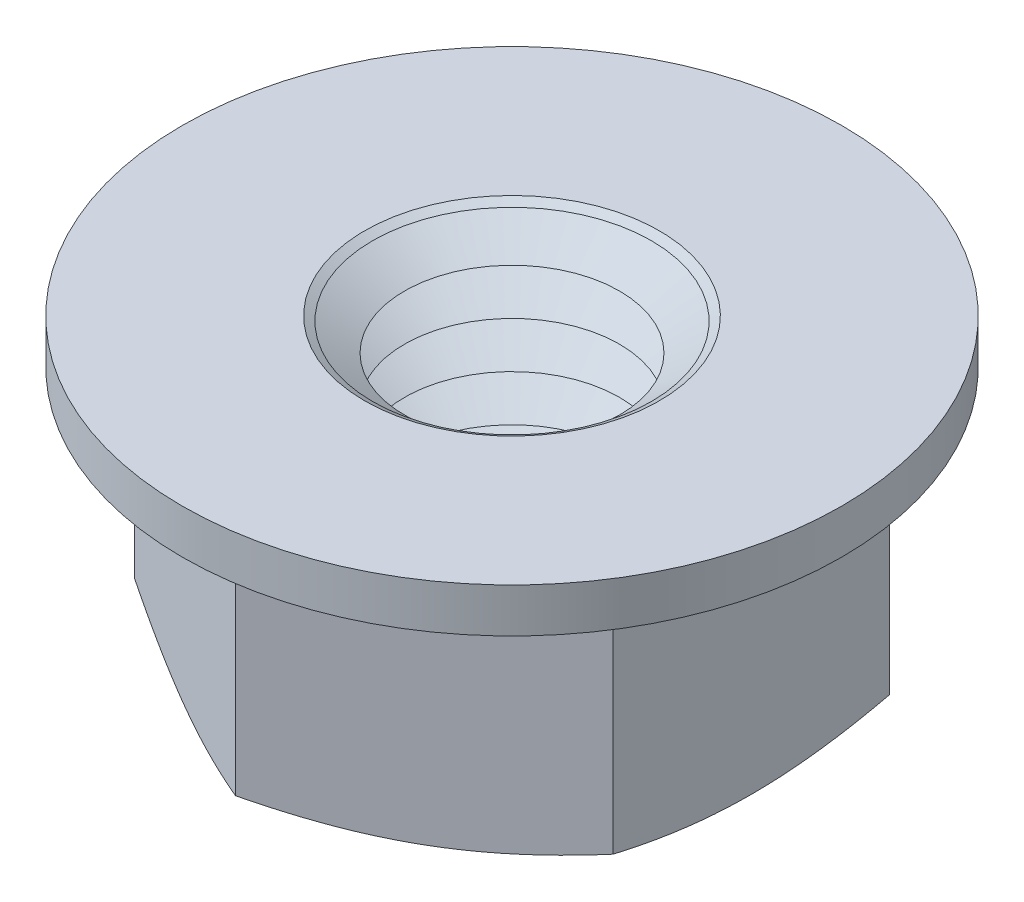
ISO-10303-21;
HEADER;
FILE_DESCRIPTION(('STEP AP214'),'2;1');
FILE_NAME('part.step','',(''),(''),'','','');
FILE_SCHEMA(('AUTOMOTIVE_DESIGN { 1 0 10303 214 1 1 1 1 }'));
ENDSEC;
DATA;
#1=APPLICATION_CONTEXT('core data for automotive mechanical design processes');
#2=APPLICATION_PROTOCOL_DEFINITION('international standard','automotive_design',2000,#1);
#3=PRODUCT_CONTEXT('',#1,'mechanical');
#4=PRODUCT('Part','Part','',(#3));
#5=PRODUCT_RELATED_PRODUCT_CATEGORY('part','',(#4));
#6=PRODUCT_DEFINITION_FORMATION('','',#4);
#7=PRODUCT_DEFINITION_CONTEXT('part definition',#1,'design');
#8=PRODUCT_DEFINITION('design','',#6,#7);
#9=PRODUCT_DEFINITION_SHAPE('','',#8);
#10=(LENGTH_UNIT() NAMED_UNIT(*) SI_UNIT(.MILLI.,.METRE.));
#11=(NAMED_UNIT(*) PLANE_ANGLE_UNIT() SI_UNIT($,.RADIAN.));
#12=(NAMED_UNIT(*) SI_UNIT($,.STERADIAN.) SOLID_ANGLE_UNIT());
#13=UNCERTAINTY_MEASURE_WITH_UNIT(LENGTH_MEASURE(1.E-05),#10,'distance_accuracy_value','');
#14=(GEOMETRIC_REPRESENTATION_CONTEXT(3) GLOBAL_UNCERTAINTY_ASSIGNED_CONTEXT((#13)) GLOBAL_UNIT_ASSIGNED_CONTEXT((#10,
#11,#12)) REPRESENTATION_CONTEXT('',''));
#15=CARTESIAN_POINT('',(0.,0.,0.));
#16=DIRECTION('',(0.,0.,1.));
#17=DIRECTION('',(1.,0.,0.));
#18=AXIS2_PLACEMENT_3D('',#15,#16,#17);
#19=CARTESIAN_POINT('',(0.,-4.62500000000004,0.));
#20=DIRECTION('',(0.,-1.,0.));
#21=DIRECTION('',(0.,0.,-1.));
#22=AXIS2_PLACEMENT_3D('',#19,#20,#21);
#23=CONICAL_SURFACE('',#22,2.91746824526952,1.04719755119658);
#24=CARTESIAN_POINT('',(0.,-5.25000000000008,0.));
#25=DIRECTION('',(0.,1.,0.));
#26=DIRECTION('',(0.,0.,1.));
#27=AXIS2_PLACEMENT_3D('',#24,#25,#26);
#28=CIRCLE('',#27,4.0000000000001);
#29=CARTESIAN_POINT('',(0.,-5.25000000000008,4.0000000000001));
#30=VERTEX_POINT('',#29);
#31=EDGE_CURVE('E206',#30,#30,#28,.T.);
#32=ORIENTED_EDGE('',*,*,#31,.F.);
#33=EDGE_LOOP('',(#32));
#34=FACE_BOUND('',#33,.T.);
#35=CARTESIAN_POINT('',(0.,-4.62500000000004,0.));
#36=DIRECTION('',(0.,-1.,0.));
#37=DIRECTION('',(0.,0.,-1.));
#38=AXIS2_PLACEMENT_3D('',#35,#36,#37);
#39=CIRCLE('',#38,2.91746824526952);
#40=CARTESIAN_POINT('',(0.,-4.62500000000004,-2.91746824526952));
#41=VERTEX_POINT('',#40);
#42=EDGE_CURVE('E209',#41,#41,#39,.T.);
#43=ORIENTED_EDGE('',*,*,#42,.F.);
#44=EDGE_LOOP('',(#43));
#45=FACE_BOUND('',#44,.T.);
#46=ADVANCED_FACE('F17',(#34,#45),#23,.F.);
#47=CARTESIAN_POINT('',(0.,-4.62500000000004,0.));
#48=DIRECTION('',(0.,1.,0.));
#49=DIRECTION('',(0.,0.,1.));
#50=AXIS2_PLACEMENT_3D('',#47,#48,#49);
#51=CONICAL_SURFACE('',#50,2.91746824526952,1.04719755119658);
#52=ORIENTED_EDGE('',*,*,#42,.T.);
#53=EDGE_LOOP('',(#52));
#54=FACE_BOUND('',#53,.T.);
#55=CARTESIAN_POINT('',(0.,-4.00000000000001,0.));
#56=DIRECTION('',(0.,-1.,0.));
#57=DIRECTION('',(0.,0.,-1.));
#58=AXIS2_PLACEMENT_3D('',#55,#56,#57);
#59=CIRCLE('',#58,4.0000000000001);
#60=CARTESIAN_POINT('',(0.,-4.00000000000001,-4.0000000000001));
#61=VERTEX_POINT('',#60);
#62=EDGE_CURVE('E203',#61,#61,#59,.T.);
#63=ORIENTED_EDGE('',*,*,#62,.F.);
#64=EDGE_LOOP('',(#63));
#65=FACE_BOUND('',#64,.T.);
#66=ADVANCED_FACE('F565',(#54,#65),#51,.F.);
#67=CARTESIAN_POINT('',(0.,-5.87500000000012,0.));
#68=DIRECTION('',(0.,1.,0.));
#69=DIRECTION('',(0.,0.,1.));
#70=AXIS2_PLACEMENT_3D('',#67,#68,#69);
#71=CONICAL_SURFACE('',#70,2.91746824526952,1.04719755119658);
#72=ORIENTED_EDGE('',*,*,#31,.T.);
#73=EDGE_LOOP('',(#72));
#74=FACE_BOUND('',#73,.T.);
#75=CARTESIAN_POINT('',(0.,-5.87500000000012,0.));
#76=DIRECTION('',(0.,1.,0.));
#77=DIRECTION('',(0.,0.,1.));
#78=AXIS2_PLACEMENT_3D('',#75,#76,#77);
#79=CIRCLE('',#78,2.91746824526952);
#80=CARTESIAN_POINT('',(0.,-5.87500000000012,2.91746824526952));
#81=VERTEX_POINT('',#80);
#82=EDGE_CURVE('E200',#81,#81,#79,.T.);
#83=ORIENTED_EDGE('',*,*,#82,.F.);
#84=EDGE_LOOP('',(#83));
#85=FACE_BOUND('',#84,.T.);
#86=ADVANCED_FACE('F557',(#74,#85),#71,.F.);
#87=CARTESIAN_POINT('',(0.,-3.37499999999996,0.));
#88=DIRECTION('',(0.,-1.,0.));
#89=DIRECTION('',(0.,0.,-1.));
#90=AXIS2_PLACEMENT_3D('',#87,#88,#89);
#91=CONICAL_SURFACE('',#90,2.91746824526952,1.04719755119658);
#92=CARTESIAN_POINT('',(0.,-3.37499999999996,0.));
#93=DIRECTION('',(0.,-1.,0.));
#94=DIRECTION('',(0.,0.,-1.));
#95=AXIS2_PLACEMENT_3D('',#92,#93,#94);
#96=CIRCLE('',#95,2.91746824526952);
#97=CARTESIAN_POINT('',(0.,-3.37499999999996,-2.91746824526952));
#98=VERTEX_POINT('',#97);
#99=EDGE_CURVE('E197',#98,#98,#96,.T.);
#100=ORIENTED_EDGE('',*,*,#99,.F.);
#101=EDGE_LOOP('',(#100));
#102=FACE_BOUND('',#101,.T.);
#103=ORIENTED_EDGE('',*,*,#62,.T.);
#104=EDGE_LOOP('',(#103));
#105=FACE_BOUND('',#104,.T.);
#106=ADVANCED_FACE('F549',(#102,#105),#91,.F.);
#107=CARTESIAN_POINT('',(0.,-5.87500000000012,0.));
#108=DIRECTION('',(0.,-1.,0.));
#109=DIRECTION('',(0.,0.,-1.));
#110=AXIS2_PLACEMENT_3D('',#107,#108,#109);
#111=CONICAL_SURFACE('',#110,2.91746824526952,1.04719755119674);
#112=CARTESIAN_POINT('',(0.,-6.49999999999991,0.));
#113=DIRECTION('',(0.,1.,0.));
#114=DIRECTION('',(0.,0.,1.));
#115=AXIS2_PLACEMENT_3D('',#112,#113,#114);
#116=CIRCLE('',#115,4.0000000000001);
#117=CARTESIAN_POINT('',(0.,-6.49999999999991,4.0000000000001));
#118=VERTEX_POINT('',#117);
#119=EDGE_CURVE('E194',#118,#118,#116,.T.);
#120=ORIENTED_EDGE('',*,*,#119,.F.);
#121=EDGE_LOOP('',(#120));
#122=FACE_BOUND('',#121,.T.);
#123=ORIENTED_EDGE('',*,*,#82,.T.);
#124=EDGE_LOOP('',(#123));
#125=FACE_BOUND('',#124,.T.);
#126=ADVANCED_FACE('F541',(#122,#125),#111,.F.);
#127=CARTESIAN_POINT('',(0.,-3.37499999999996,0.));
#128=DIRECTION('',(0.,1.,0.));
#129=DIRECTION('',(0.,0.,1.));
#130=AXIS2_PLACEMENT_3D('',#127,#128,#129);
#131=CONICAL_SURFACE('',#130,2.91746824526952,1.04719755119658);
#132=ORIENTED_EDGE('',*,*,#99,.T.);
#133=EDGE_LOOP('',(#132));
#134=FACE_BOUND('',#133,.T.);
#135=CARTESIAN_POINT('',(0.,-2.74999999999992,0.));
#136=DIRECTION('',(0.,-1.,0.));
#137=DIRECTION('',(1.,0.,0.));
#138=AXIS2_PLACEMENT_3D('',#135,#136,#137);
#139=CIRCLE('',#138,4.0000000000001);
#140=CARTESIAN_POINT('',(4.0000000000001,-2.74999999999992,0.));
#141=VERTEX_POINT('',#140);
#142=EDGE_CURVE('E191',#141,#141,#139,.T.);
#143=ORIENTED_EDGE('',*,*,#142,.F.);
#144=EDGE_LOOP('',(#143));
#145=FACE_BOUND('',#144,.T.);
#146=ADVANCED_FACE('F533',(#134,#145),#131,.F.);
#147=CARTESIAN_POINT('',(0.,-7.12499999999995,0.));
#148=DIRECTION('',(0.,1.,0.));
#149=DIRECTION('',(-1.,0.,0.));
#150=AXIS2_PLACEMENT_3D('',#147,#148,#149);
#151=CONICAL_SURFACE('',#150,2.91746824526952,1.04719755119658);
#152=ORIENTED_EDGE('',*,*,#119,.T.);
#153=EDGE_LOOP('',(#152));
#154=FACE_BOUND('',#153,.T.);
#155=CARTESIAN_POINT('',(0.,-7.12499999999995,0.));
#156=DIRECTION('',(0.,1.,0.));
#157=DIRECTION('',(-1.,0.,0.));
#158=AXIS2_PLACEMENT_3D('',#155,#156,#157);
#159=CIRCLE('',#158,2.91746824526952);
#160=CARTESIAN_POINT('',(-2.91746824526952,-7.12499999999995,0.));
#161=VERTEX_POINT('',#160);
#162=EDGE_CURVE('E188',#161,#161,#159,.T.);
#163=ORIENTED_EDGE('',*,*,#162,.F.);
#164=EDGE_LOOP('',(#163));
#165=FACE_BOUND('',#164,.T.);
#166=ADVANCED_FACE('F525',(#154,#165),#151,.F.);
#167=CARTESIAN_POINT('',(0.,-2.12499999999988,0.));
#168=DIRECTION('',(0.,-1.,0.));
#169=DIRECTION('',(0.,0.,-1.));
#170=AXIS2_PLACEMENT_3D('',#167,#168,#169);
#171=CONICAL_SURFACE('',#170,2.91746824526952,1.04719755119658);
#172=CARTESIAN_POINT('',(0.,-2.12499999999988,0.));
#173=DIRECTION('',(0.,-1.,0.));
#174=DIRECTION('',(0.,0.,-1.));
#175=AXIS2_PLACEMENT_3D('',#172,#173,#174);
#176=CIRCLE('',#175,2.91746824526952);
#177=CARTESIAN_POINT('',(0.,-2.12499999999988,-2.91746824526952));
#178=VERTEX_POINT('',#177);
#179=EDGE_CURVE('E185',#178,#178,#176,.T.);
#180=ORIENTED_EDGE('',*,*,#179,.F.);
#181=EDGE_LOOP('',(#180));
#182=FACE_BOUND('',#181,.T.);
#183=ORIENTED_EDGE('',*,*,#142,.T.);
#184=EDGE_LOOP('',(#183));
#185=FACE_BOUND('',#184,.T.);
#186=ADVANCED_FACE('F517',(#182,#185),#171,.F.);
#187=CARTESIAN_POINT('',(0.,-7.12499999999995,0.));
#188=DIRECTION('',(0.,-1.,0.));
#189=DIRECTION('',(1.,0.,0.));
#190=AXIS2_PLACEMENT_3D('',#187,#188,#189);
#191=CONICAL_SURFACE('',#190,2.91746824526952,1.04719755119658);
#192=CARTESIAN_POINT('',(0.,-7.75000000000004,0.));
#193=DIRECTION('',(0.,1.,0.));
#194=DIRECTION('',(0.,0.,1.));
#195=AXIS2_PLACEMENT_3D('',#192,#193,#194);
#196=CIRCLE('',#195,4.00000000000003);
#197=CARTESIAN_POINT('',(0.,-7.75000000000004,4.00000000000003));
#198=VERTEX_POINT('',#197);
#199=EDGE_CURVE('E182',#198,#198,#196,.T.);
#200=ORIENTED_EDGE('',*,*,#199,.F.);
#201=EDGE_LOOP('',(#200));
#202=FACE_BOUND('',#201,.T.);
#203=ORIENTED_EDGE('',*,*,#162,.T.);
#204=EDGE_LOOP('',(#203));
#205=FACE_BOUND('',#204,.T.);
#206=ADVANCED_FACE('F509',(#202,#205),#191,.F.);
#207=CARTESIAN_POINT('',(0.,-2.12499999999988,0.));
#208=DIRECTION('',(0.,1.,0.));
#209=DIRECTION('',(0.,0.,1.));
#210=AXIS2_PLACEMENT_3D('',#207,#208,#209);
#211=CONICAL_SURFACE('',#210,2.91746824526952,1.04719755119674);
#212=ORIENTED_EDGE('',*,*,#179,.T.);
#213=EDGE_LOOP('',(#212));
#214=FACE_BOUND('',#213,.T.);
#215=CARTESIAN_POINT('',(0.,-1.5000000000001,0.));
#216=DIRECTION('',(0.,-1.,0.));
#217=DIRECTION('',(0.,0.,-1.));
#218=AXIS2_PLACEMENT_3D('',#215,#216,#217);
#219=CIRCLE('',#218,4.0000000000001);
#220=CARTESIAN_POINT('',(0.,-1.5000000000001,-4.0000000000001));
#221=VERTEX_POINT('',#220);
#222=EDGE_CURVE('E179',#221,#221,#219,.T.);
#223=ORIENTED_EDGE('',*,*,#222,.F.);
#224=EDGE_LOOP('',(#223));
#225=FACE_BOUND('',#224,.T.);
#226=ADVANCED_FACE('F501',(#214,#225),#211,.F.);
#227=CARTESIAN_POINT('',(0.,-7.875,0.));
#228=DIRECTION('',(0.,1.,0.));
#229=DIRECTION('',(-1.,0.,0.));
#230=AXIS2_PLACEMENT_3D('',#227,#228,#229);
#231=CONICAL_SURFACE('',#230,3.78349364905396,1.04719755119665);
#232=ORIENTED_EDGE('',*,*,#199,.T.);
#233=EDGE_LOOP('',(#232));
#234=FACE_BOUND('',#233,.T.);
#235=CARTESIAN_POINT('',(0.,-7.875,0.));
#236=DIRECTION('',(0.,1.,0.));
#237=DIRECTION('',(-1.,0.,0.));
#238=AXIS2_PLACEMENT_3D('',#235,#236,#237);
#239=CIRCLE('',#238,3.78349364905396);
#240=CARTESIAN_POINT('',(-3.78349364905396,-7.875,0.));
#241=VERTEX_POINT('',#240);
#242=EDGE_CURVE('E176',#241,#241,#239,.T.);
#243=ORIENTED_EDGE('',*,*,#242,.F.);
#244=EDGE_LOOP('',(#243));
#245=FACE_BOUND('',#244,.T.);
#246=ADVANCED_FACE('F493',(#234,#245),#231,.F.);
#247=CARTESIAN_POINT('',(0.,-0.875000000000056,0.));
#248=DIRECTION('',(0.,-1.,0.));
#249=DIRECTION('',(1.,0.,0.));
#250=AXIS2_PLACEMENT_3D('',#247,#248,#249);
#251=CONICAL_SURFACE('',#250,2.91746824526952,1.04719755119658);
#252=CARTESIAN_POINT('',(0.,-0.875000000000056,0.));
#253=DIRECTION('',(0.,-1.,0.));
#254=DIRECTION('',(1.,0.,0.));
#255=AXIS2_PLACEMENT_3D('',#252,#253,#254);
#256=CIRCLE('',#255,2.91746824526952);
#257=CARTESIAN_POINT('',(2.91746824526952,-0.875000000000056,0.));
#258=VERTEX_POINT('',#257);
#259=EDGE_CURVE('E102',#258,#258,#256,.T.);
#260=ORIENTED_EDGE('',*,*,#259,.F.);
#261=EDGE_LOOP('',(#260));
#262=FACE_BOUND('',#261,.T.);
#263=ORIENTED_EDGE('',*,*,#222,.T.);
#264=EDGE_LOOP('',(#263));
#265=FACE_BOUND('',#264,.T.);
#266=ADVANCED_FACE('F486',(#262,#265),#251,.F.);
#267=CARTESIAN_POINT('',(0.,-7.875,0.));
#268=DIRECTION('',(0.,-1.,0.));
#269=DIRECTION('',(1.,0.,0.));
#270=AXIS2_PLACEMENT_3D('',#267,#268,#269);
#271=CONICAL_SURFACE('',#270,3.78349364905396,1.04719755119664);
#272=CARTESIAN_POINT('',(0.,-8.00000000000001,0.));
#273=DIRECTION('',(0.,-1.,0.));
#274=DIRECTION('',(0.,0.,-1.));
#275=AXIS2_PLACEMENT_3D('',#272,#273,#274);
#276=CIRCLE('',#275,4.00000000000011);
#277=CARTESIAN_POINT('',(0.,-8.00000000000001,-4.00000000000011));
#278=VERTEX_POINT('',#277);
#279=EDGE_CURVE('E160',#278,#278,#276,.F.);
#280=ORIENTED_EDGE('',*,*,#279,.F.);
#281=EDGE_LOOP('',(#280));
#282=FACE_BOUND('',#281,.T.);
#283=ORIENTED_EDGE('',*,*,#242,.T.);
#284=EDGE_LOOP('',(#283));
#285=FACE_BOUND('',#284,.T.);
#286=ADVANCED_FACE('F479',(#282,#285),#271,.F.);
#287=CARTESIAN_POINT('',(0.,-0.875000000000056,0.));
#288=DIRECTION('',(0.,1.,0.));
#289=DIRECTION('',(-1.,0.,0.));
#290=AXIS2_PLACEMENT_3D('',#287,#288,#289);
#291=CONICAL_SURFACE('',#290,2.91746824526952,1.04719755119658);
#292=ORIENTED_EDGE('',*,*,#259,.T.);
#293=EDGE_LOOP('',(#292));
#294=FACE_BOUND('',#293,.T.);
#295=CARTESIAN_POINT('',(0.,-0.24999999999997,0.));
#296=DIRECTION('',(0.,-1.,0.));
#297=DIRECTION('',(0.,0.,-1.));
#298=AXIS2_PLACEMENT_3D('',#295,#296,#297);
#299=CIRCLE('',#298,4.00000000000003);
#300=CARTESIAN_POINT('',(0.,-0.24999999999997,-4.00000000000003));
#301=VERTEX_POINT('',#300);
#302=EDGE_CURVE('E164',#301,#301,#299,.T.);
#303=ORIENTED_EDGE('',*,*,#302,.F.);
#304=EDGE_LOOP('',(#303));
#305=FACE_BOUND('',#304,.T.);
#306=ADVANCED_FACE('F137',(#294,#305),#291,.F.);
#307=CARTESIAN_POINT('',(1.95590071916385E-13,-7.48111825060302,6.92879727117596E-13));
#308=DIRECTION('',(0.,1.,0.));
#309=DIRECTION('',(-1.,0.,0.));
#310=AXIS2_PLACEMENT_3D('',#307,#308,#309);
#311=CONICAL_SURFACE('',#310,7.61274550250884,1.13446401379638);
#312=CARTESIAN_POINT('',(1.95590071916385E-13,-8.00000000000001,6.84722291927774E-13));
#313=DIRECTION('',(0.,-1.,0.));
#314=DIRECTION('',(0.,0.,-1.));
#315=AXIS2_PLACEMENT_3D('',#312,#313,#314);
#316=CIRCLE('',#315,6.50000000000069);
#317=CARTESIAN_POINT('',(-6.5000000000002,-8.00000000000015,0.));
#318=VERTEX_POINT('',#317);
#319=CARTESIAN_POINT('',(-3.2500000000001,-8.00000000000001,-5.62916512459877));
#320=VERTEX_POINT('',#319);
#321=EDGE_CURVE('E97',#318,#320,#316,.T.);
#322=ORIENTED_EDGE('',*,*,#321,.F.);
#323=CARTESIAN_POINT('',(-6.49999999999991,-7.53110270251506,-3.75277674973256));
#324=CARTESIAN_POINT('',(-6.49999999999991,-7.60291701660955,-3.44487637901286));
#325=CARTESIAN_POINT('',(-6.49999999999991,-7.66845556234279,-3.1353170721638));
#326=CARTESIAN_POINT('',(-6.49999999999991,-7.7838219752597,-2.514385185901));
#327=CARTESIAN_POINT('',(-6.49999999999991,-7.83370190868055,-2.20302219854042));
#328=CARTESIAN_POINT('',(-6.49999999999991,-7.89477851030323,-1.73405633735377));
#329=CARTESIAN_POINT('',(-6.49999999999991,-7.91285157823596,-1.57734721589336));
#330=CARTESIAN_POINT('',(-6.49999999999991,-7.94410021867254,-1.26343980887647));
#331=CARTESIAN_POINT('',(-6.49999999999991,-7.95727586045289,-1.10624153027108));
#332=CARTESIAN_POINT('',(-6.49999999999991,-7.97850910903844,-0.790970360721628));
#333=CARTESIAN_POINT('',(-6.49999999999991,-7.98654948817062,-0.632896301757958));
#334=CARTESIAN_POINT('',(-6.49999999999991,-7.99730463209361,-0.316549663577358));
#335=CARTESIAN_POINT('',(-6.49999999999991,-8.00001878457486,-0.158277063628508));
#336=CARTESIAN_POINT('',(-6.49999999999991,-8.00000000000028,0.));
#337=B_SPLINE_CURVE_WITH_KNOTS('',3,(#323,#324,#325,#326,#327,#328,#329,#330,#331,#332,#333,
#334,#335,#336),.UNSPECIFIED.,.F.,.F.,(4,2,2,2,2,2,4),(0.,0.948732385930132,1.89427589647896,
2.36744958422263,2.84061657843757,3.31536271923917,3.79016343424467),.UNSPECIFIED.);
#338=CARTESIAN_POINT('',(-6.49999999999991,-7.53110270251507,-3.75277674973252));
#339=VERTEX_POINT('',#338);
#340=EDGE_CURVE('E21',#339,#318,#337,.T.);
#341=ORIENTED_EDGE('',*,*,#340,.F.);
#342=CARTESIAN_POINT('',(-3.24999999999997,-8.00000000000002,-5.62916512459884));
#343=CARTESIAN_POINT('',(-3.38707195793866,-8.0000187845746,-5.55002659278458));
#344=CARTESIAN_POINT('',(-3.52414005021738,-7.99730463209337,-5.47089029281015));
#345=CARTESIAN_POINT('',(-3.79810427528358,-7.9865494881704,-5.31271697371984));
#346=CARTESIAN_POINT('',(-3.93500042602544,-7.97850910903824,-5.233679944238));
#347=CARTESIAN_POINT('',(-4.2080332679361,-7.95727586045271,-5.07604435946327));
#348=CARTESIAN_POINT('',(-4.34417097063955,-7.94410021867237,-4.99744522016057));
#349=CARTESIAN_POINT('',(-4.61602275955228,-7.91285157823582,-4.84049151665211));
#350=CARTESIAN_POINT('',(-4.75173683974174,-7.8947785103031,-4.7621369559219));
#351=CARTESIAN_POINT('',(-5.15787318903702,-7.83370190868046,-4.52765402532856));
#352=CARTESIAN_POINT('',(-5.4275214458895,-7.78382197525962,-4.37197253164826));
#353=CARTESIAN_POINT('',(-5.96526423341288,-7.66845556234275,-4.06150658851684));
#354=CARTESIAN_POINT('',(-6.23335045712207,-7.60291701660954,-3.9067269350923));
#355=CARTESIAN_POINT('',(-6.49999999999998,-7.53110270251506,-3.75277674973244));
#356=B_SPLINE_CURVE_WITH_KNOTS('',3,(#342,#343,#344,#345,#346,#347,#348,#349,#350,#351,#352,
#353,#354,#355),.UNSPECIFIED.,.F.,.F.,(4,2,2,2,2,2,4),(0.,0.474800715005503,0.949546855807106,
1.42271385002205,1.89588753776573,2.84143104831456,3.79016343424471),.UNSPECIFIED.);
#357=EDGE_CURVE('E95',#320,#339,#356,.T.);
#358=ORIENTED_EDGE('',*,*,#357,.F.);
#359=EDGE_LOOP('',(#322,#341,#358));
#360=FACE_BOUND('',#359,.T.);
#361=ADVANCED_FACE('F93',(#360),#311,.T.);
#362=CARTESIAN_POINT('',(-6.49999999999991,-8.03579629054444,-3.75277674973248));
#363=DIRECTION('',(-1.,0.,0.));
#364=DIRECTION('',(0.,0.,1.));
#365=AXIS2_PLACEMENT_3D('',#362,#363,#364);
#366=PLANE('',#365);
#367=CARTESIAN_POINT('',(-6.49999999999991,-7.53110270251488,3.75277674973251));
#368=CARTESIAN_POINT('',(-6.49999999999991,-7.60291701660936,3.44487637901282));
#369=CARTESIAN_POINT('',(-6.49999999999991,-7.66845556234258,3.13531707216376));
#370=CARTESIAN_POINT('',(-6.49999999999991,-7.78382197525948,2.51438518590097));
#371=CARTESIAN_POINT('',(-6.49999999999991,-7.83370190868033,2.20302219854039));
#372=CARTESIAN_POINT('',(-6.49999999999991,-7.894778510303,1.73405633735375));
#373=CARTESIAN_POINT('',(-6.49999999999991,-7.91285157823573,1.57734721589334));
#374=CARTESIAN_POINT('',(-6.49999999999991,-7.9441002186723,1.26343980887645));
#375=CARTESIAN_POINT('',(-6.49999999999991,-7.95727586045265,1.10624153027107));
#376=CARTESIAN_POINT('',(-6.49999999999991,-7.9785091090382,0.790970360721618));
#377=CARTESIAN_POINT('',(-6.49999999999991,-7.98654948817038,0.632896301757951));
#378=CARTESIAN_POINT('',(-6.49999999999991,-7.99730463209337,0.316549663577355));
#379=CARTESIAN_POINT('',(-6.49999999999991,-8.00001878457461,0.158277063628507));
#380=CARTESIAN_POINT('',(-6.49999999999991,-8.00000000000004,0.));
#381=B_SPLINE_CURVE_WITH_KNOTS('',3,(#367,#368,#369,#370,#371,#372,#373,#374,#375,#376,#377,
#378,#379,#380),.UNSPECIFIED.,.F.,.F.,(4,2,2,2,2,2,4),(0.,0.948732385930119,1.89427589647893,
2.36744958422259,2.84061657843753,3.31536271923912,3.79016343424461),.UNSPECIFIED.);
#382=CARTESIAN_POINT('',(-6.49999999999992,-7.53110270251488,3.75277674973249));
#383=VERTEX_POINT('',#382);
#384=EDGE_CURVE('E101',#383,#318,#381,.T.);
#385=ORIENTED_EDGE('',*,*,#384,.F.);
#386=DIRECTION('',(0.,-1.,0.));
#387=VECTOR('',#386,1.);
#388=CARTESIAN_POINT('',(-6.49999999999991,-5.01697578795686,3.75277674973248));
#389=LINE('',#388,#387);
#390=CARTESIAN_POINT('',(-6.49999999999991,-2.03395157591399,3.7527767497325));
#391=VERTEX_POINT('',#390);
#392=EDGE_CURVE('E379',#391,#383,#389,.T.);
#393=ORIENTED_EDGE('',*,*,#392,.F.);
#394=CARTESIAN_POINT('',(-6.49999999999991,-2.03395157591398,-3.75277674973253));
#395=CARTESIAN_POINT('',(-6.49999999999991,-2.08156764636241,-3.58779801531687));
#396=CARTESIAN_POINT('',(-6.49999999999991,-2.1270225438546,-3.42220416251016));
#397=CARTESIAN_POINT('',(-6.49999999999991,-2.21301478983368,-3.08967168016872));
#398=CARTESIAN_POINT('',(-6.49999999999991,-2.25355001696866,-2.92273250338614));
#399=CARTESIAN_POINT('',(-6.49999999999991,-2.36698047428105,-2.41924225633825));
#400=CARTESIAN_POINT('',(-6.49999999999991,-2.43149741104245,-2.08070380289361));
#401=CARTESIAN_POINT('',(-6.49999999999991,-2.5071493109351,-1.57408720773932));
#402=CARTESIAN_POINT('',(-6.49999999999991,-2.5286999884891,-1.40752263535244));
#403=CARTESIAN_POINT('',(-6.49999999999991,-2.5648364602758,-1.07364097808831));
#404=CARTESIAN_POINT('',(-6.49999999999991,-2.57942286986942,-0.906323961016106));
#405=CARTESIAN_POINT('',(-6.49999999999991,-2.60125906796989,-0.571399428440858));
#406=CARTESIAN_POINT('',(-6.49999999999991,-2.60851718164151,-0.403792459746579));
#407=CARTESIAN_POINT('',(-6.49999999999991,-2.6155489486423,-0.0684330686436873));
#408=CARTESIAN_POINT('',(-6.49999999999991,-2.61532283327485,0.0993193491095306));
#409=CARTESIAN_POINT('',(-6.49999999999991,-2.60441660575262,0.558877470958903));
#410=CARTESIAN_POINT('',(-6.49999999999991,-2.58611713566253,0.850532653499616));
#411=CARTESIAN_POINT('',(-6.49999999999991,-2.52809561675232,1.43190592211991));
#412=CARTESIAN_POINT('',(-6.49999999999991,-2.48835374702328,1.72162196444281));
#413=CARTESIAN_POINT('',(-6.49999999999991,-2.38901306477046,2.30416471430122));
#414=CARTESIAN_POINT('',(-6.49999999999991,-2.32899346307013,2.59691793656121));
#415=CARTESIAN_POINT('',(-6.49999999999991,-2.19277412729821,3.17805924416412));
#416=CARTESIAN_POINT('',(-6.49999999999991,-2.11660637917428,3.46645476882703));
#417=CARTESIAN_POINT('',(-6.49999999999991,-2.03395157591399,3.75277674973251));
#418=B_SPLINE_CURVE_WITH_KNOTS('',3,(#394,#395,#396,#397,#398,#399,#400,#401,#402,#403,#404,
#405,#406,#407,#408,#409,#410,#411,#412,#413,#414,#415,#416,#417),.UNSPECIFIED.,.F.,.F.,(4,2,2,
2,2,2,2,2,2,2,2,4),(0.,0.515097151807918,1.03041562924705,2.06319349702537,2.56693469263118,
3.07063136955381,3.57375518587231,4.07686345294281,4.95263085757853,5.82920919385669,
6.72522583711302,7.61948397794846),.UNSPECIFIED.);
#419=CARTESIAN_POINT('',(-6.49999999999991,-2.03395157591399,-3.7527767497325));
#420=VERTEX_POINT('',#419);
#421=EDGE_CURVE('E107',#420,#391,#418,.T.);
#422=ORIENTED_EDGE('',*,*,#421,.F.);
#423=DIRECTION('',(0.,1.,0.));
#424=VECTOR('',#423,1.);
#425=CARTESIAN_POINT('',(-6.49999999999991,-5.01697578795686,-3.75277674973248));
#426=LINE('',#425,#424);
#427=EDGE_CURVE('E104',#339,#420,#426,.T.);
#428=ORIENTED_EDGE('',*,*,#427,.F.);
#429=ORIENTED_EDGE('',*,*,#340,.T.);
#430=EDGE_LOOP('',(#385,#393,#422,#428,#429));
#431=FACE_BOUND('',#430,.T.);
#432=ADVANCED_FACE('F105',(#431),#366,.T.);
#433=CARTESIAN_POINT('',(1.95806912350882E-13,-7.48111825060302,-6.9331340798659E-13));
#434=DIRECTION('',(0.,1.,0.));
#435=DIRECTION('',(-1.,0.,0.));
#436=AXIS2_PLACEMENT_3D('',#433,#434,#435);
#437=CONICAL_SURFACE('',#436,7.61274550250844,1.13446401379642);
#438=CARTESIAN_POINT('',(1.95806912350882E-13,-8.00000000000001,-7.01470843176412E-13));
#439=DIRECTION('',(0.,-1.,0.));
#440=DIRECTION('',(0.,0.,-1.));
#441=AXIS2_PLACEMENT_3D('',#438,#439,#440);
#442=CIRCLE('',#441,6.50000000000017);
#443=CARTESIAN_POINT('',(-3.24999999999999,-8.00000000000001,5.62916512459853));
#444=VERTEX_POINT('',#443);
#445=EDGE_CURVE('E158',#444,#318,#442,.T.);
#446=ORIENTED_EDGE('',*,*,#445,.F.);
#447=CARTESIAN_POINT('',(-6.49999999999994,-7.53110270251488,3.75277674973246));
#448=CARTESIAN_POINT('',(-6.23335045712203,-7.60291701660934,3.90672693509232));
#449=CARTESIAN_POINT('',(-5.96526423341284,-7.66845556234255,4.06150658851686));
#450=CARTESIAN_POINT('',(-5.42752144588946,-7.78382197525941,4.37197253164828));
#451=CARTESIAN_POINT('',(-5.15787318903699,-7.83370190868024,4.52765402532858));
#452=CARTESIAN_POINT('',(-4.75173683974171,-7.89477851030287,4.76213695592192));
#453=CARTESIAN_POINT('',(-4.61602275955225,-7.91285157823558,4.84049151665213));
#454=CARTESIAN_POINT('',(-4.34417097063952,-7.94410021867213,4.99744522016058));
#455=CARTESIAN_POINT('',(-4.20803326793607,-7.95727586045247,5.07604435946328));
#456=CARTESIAN_POINT('',(-3.93500042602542,-7.978509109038,5.23367994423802));
#457=CARTESIAN_POINT('',(-3.79810427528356,-7.98654948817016,5.31271697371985));
#458=CARTESIAN_POINT('',(-3.52414005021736,-7.99730463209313,5.47089029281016));
#459=CARTESIAN_POINT('',(-3.38707195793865,-8.00001878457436,5.55002659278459));
#460=CARTESIAN_POINT('',(-3.24999999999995,-7.99999999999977,5.62916512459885));
#461=B_SPLINE_CURVE_WITH_KNOTS('',3,(#447,#448,#449,#450,#451,#452,#453,#454,#455,#456,#457,
#458,#459,#460),.UNSPECIFIED.,.F.,.F.,(4,2,2,2,2,2,4),(0.,0.948732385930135,1.89427589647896,
2.36744958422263,2.84061657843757,3.31536271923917,3.79016343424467),.UNSPECIFIED.);
#462=EDGE_CURVE('E313',#383,#444,#461,.T.);
#463=ORIENTED_EDGE('',*,*,#462,.F.);
#464=ORIENTED_EDGE('',*,*,#384,.T.);
#465=EDGE_LOOP('',(#446,#463,#464));
#466=FACE_BOUND('',#465,.T.);
#467=ADVANCED_FACE('F143',(#466),#437,.T.);
#468=CARTESIAN_POINT('',(-6.57800000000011,-8.00000000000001,6.57800000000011));
#469=DIRECTION('',(0.,-1.,0.));
#470=DIRECTION('',(0.,0.,-1.));
#471=AXIS2_PLACEMENT_3D('',#468,#469,#470);
#472=PLANE('',#471);
#473=ORIENTED_EDGE('',*,*,#279,.T.);
#474=EDGE_LOOP('',(#473));
#475=FACE_BOUND('',#474,.T.);
#476=ORIENTED_EDGE('',*,*,#321,.T.);
#477=CARTESIAN_POINT('',(0.,-8.00000000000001,-5.08392263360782E-13));
#478=DIRECTION('',(0.,1.,0.));
#479=DIRECTION('',(0.,0.,1.));
#480=AXIS2_PLACEMENT_3D('',#477,#478,#479);
#481=CIRCLE('',#480,6.49999999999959);
#482=CARTESIAN_POINT('',(3.24999999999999,-8.00000000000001,-5.62916512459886));
#483=VERTEX_POINT('',#482);
#484=EDGE_CURVE('E167',#483,#320,#481,.T.);
#485=ORIENTED_EDGE('',*,*,#484,.F.);
#486=CARTESIAN_POINT('',(-5.8487495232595E-13,-8.,6.90946947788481E-13));
#487=DIRECTION('',(0.,1.,0.));
#488=DIRECTION('',(-1.,0.,0.));
#489=AXIS2_PLACEMENT_3D('',#486,#487,#488);
#490=CIRCLE('',#489,6.50000000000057);
#491=CARTESIAN_POINT('',(6.49999999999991,-8.00000000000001,0.));
#492=VERTEX_POINT('',#491);
#493=EDGE_CURVE('E358',#492,#483,#490,.T.);
#494=ORIENTED_EDGE('',*,*,#493,.F.);
#495=CARTESIAN_POINT('',(-1.95863212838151E-13,-8.00000000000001,-6.93037425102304E-13));
#496=DIRECTION('',(0.,1.,0.));
#497=DIRECTION('',(-1.,0.,0.));
#498=AXIS2_PLACEMENT_3D('',#495,#496,#497);
#499=CIRCLE('',#498,6.5000000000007);
#500=CARTESIAN_POINT('',(3.25000000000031,-8.00000000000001,5.62916512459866));
#501=VERTEX_POINT('',#500);
#502=EDGE_CURVE('E362',#501,#492,#499,.T.);
#503=ORIENTED_EDGE('',*,*,#502,.F.);
#504=CARTESIAN_POINT('',(0.,-8.00000000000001,-1.31361935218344E-12));
#505=DIRECTION('',(0.,1.,0.));
#506=DIRECTION('',(0.,0.,1.));
#507=AXIS2_PLACEMENT_3D('',#504,#505,#506);
#508=CIRCLE('',#507,6.50000000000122);
#509=EDGE_CURVE('E312',#444,#501,#508,.T.);
#510=ORIENTED_EDGE('',*,*,#509,.F.);
#511=ORIENTED_EDGE('',*,*,#445,.T.);
#512=EDGE_LOOP('',(#476,#485,#494,#503,#510,#511));
#513=FACE_BOUND('',#512,.T.);
#514=ADVANCED_FACE('F302',(#475,#513),#472,.T.);
#515=CARTESIAN_POINT('',(0.,-0.125000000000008,0.));
#516=DIRECTION('',(0.,-1.,0.));
#517=DIRECTION('',(0.,0.,-1.));
#518=AXIS2_PLACEMENT_3D('',#515,#516,#517);
#519=CONICAL_SURFACE('',#518,3.78349364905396,1.04719755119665);
#520=CARTESIAN_POINT('',(0.,-0.125000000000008,0.));
#521=DIRECTION('',(0.,-1.,0.));
#522=DIRECTION('',(0.,0.,-1.));
#523=AXIS2_PLACEMENT_3D('',#520,#521,#522);
#524=CIRCLE('',#523,3.78349364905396);
#525=CARTESIAN_POINT('',(0.,-0.125000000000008,-3.78349364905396));
#526=VERTEX_POINT('',#525);
#527=EDGE_CURVE('E356',#526,#526,#524,.T.);
#528=ORIENTED_EDGE('',*,*,#527,.F.);
#529=EDGE_LOOP('',(#528));
#530=FACE_BOUND('',#529,.T.);
#531=ORIENTED_EDGE('',*,*,#302,.T.);
#532=EDGE_LOOP('',(#531));
#533=FACE_BOUND('',#532,.T.);
#534=ADVANCED_FACE('F297',(#530,#533),#519,.F.);
#535=CARTESIAN_POINT('',(0.,-7.48111825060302,-5.08707659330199E-13));
#536=DIRECTION('',(0.,1.,0.));
#537=DIRECTION('',(0.,0.,1.));
#538=AXIS2_PLACEMENT_3D('',#535,#536,#537);
#539=CONICAL_SURFACE('',#538,7.61274550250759,1.13446401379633);
#540=ORIENTED_EDGE('',*,*,#484,.T.);
#541=CARTESIAN_POINT('',(0.,-7.53110270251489,-7.50555349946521));
#542=CARTESIAN_POINT('',(-0.266649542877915,-7.60291701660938,-7.35160331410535));
#543=CARTESIAN_POINT('',(-0.534735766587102,-7.66845556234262,-7.19682366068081));
#544=CARTESIAN_POINT('',(-1.07247855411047,-7.78382197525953,-6.8863577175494));
#545=CARTESIAN_POINT('',(-1.34212681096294,-7.83370190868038,-6.7306762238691));
#546=CARTESIAN_POINT('',(-1.74826316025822,-7.89477851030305,-6.49619329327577));
#547=CARTESIAN_POINT('',(-1.88397724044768,-7.91285157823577,-6.41783873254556));
#548=CARTESIAN_POINT('',(-2.1558290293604,-7.94410021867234,-6.26088502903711));
#549=CARTESIAN_POINT('',(-2.29196673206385,-7.95727586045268,-6.18228588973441));
#550=CARTESIAN_POINT('',(-2.56499957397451,-7.97850910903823,-6.02465030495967));
#551=CARTESIAN_POINT('',(-2.70189572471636,-7.9865494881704,-5.94561327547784));
#552=CARTESIAN_POINT('',(-2.97585994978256,-7.99730463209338,-5.78743995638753));
#553=CARTESIAN_POINT('',(-3.11292804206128,-8.00001878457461,-5.7083036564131));
#554=CARTESIAN_POINT('',(-3.24999999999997,-8.00000000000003,-5.62916512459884));
#555=B_SPLINE_CURVE_WITH_KNOTS('',3,(#541,#542,#543,#544,#545,#546,#547,#548,#549,#550,#551,
#552,#553,#554),.UNSPECIFIED.,.F.,.F.,(4,2,2,2,2,2,4),(0.,0.948732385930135,1.89427589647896,
2.36744958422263,2.84061657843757,3.31536271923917,3.79016343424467),.UNSPECIFIED.);
#556=CARTESIAN_POINT('',(0.,-7.53110270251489,-7.50555349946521));
#557=VERTEX_POINT('',#556);
#558=EDGE_CURVE('E114',#557,#320,#555,.T.);
#559=ORIENTED_EDGE('',*,*,#558,.F.);
#560=CARTESIAN_POINT('',(3.24999999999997,-8.00000000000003,-5.62916512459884));
#561=CARTESIAN_POINT('',(3.11292804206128,-8.00001878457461,-5.7083036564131));
#562=CARTESIAN_POINT('',(2.97585994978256,-7.99730463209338,-5.78743995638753));
#563=CARTESIAN_POINT('',(2.70189572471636,-7.9865494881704,-5.94561327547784));
#564=CARTESIAN_POINT('',(2.5649995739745,-7.97850910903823,-6.02465030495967));
#565=CARTESIAN_POINT('',(2.29196673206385,-7.95727586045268,-6.18228588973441));
#566=CARTESIAN_POINT('',(2.1558290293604,-7.94410021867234,-6.26088502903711));
#567=CARTESIAN_POINT('',(1.88397724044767,-7.91285157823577,-6.41783873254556));
#568=CARTESIAN_POINT('',(1.74826316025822,-7.89477851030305,-6.49619329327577));
#569=CARTESIAN_POINT('',(1.34212681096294,-7.83370190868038,-6.7306762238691));
#570=CARTESIAN_POINT('',(1.07247855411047,-7.78382197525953,-6.8863577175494));
#571=CARTESIAN_POINT('',(0.534735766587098,-7.66845556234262,-7.19682366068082));
#572=CARTESIAN_POINT('',(0.26664954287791,-7.60291701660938,-7.35160331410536));
#573=CARTESIAN_POINT('',(0.,-7.53110270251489,-7.50555349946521));
#574=B_SPLINE_CURVE_WITH_KNOTS('',3,(#560,#561,#562,#563,#564,#565,#566,#567,#568,#569,#570,
#571,#572,#573),.UNSPECIFIED.,.F.,.F.,(4,2,2,2,2,2,4),(0.,0.4748007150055,0.949546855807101,
1.42271385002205,1.89588753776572,2.84143104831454,3.79016343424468),.UNSPECIFIED.);
#575=EDGE_CURVE('E253',#483,#557,#574,.T.);
#576=ORIENTED_EDGE('',*,*,#575,.F.);
#577=EDGE_LOOP('',(#540,#559,#576));
#578=FACE_BOUND('',#577,.T.);
#579=ADVANCED_FACE('F293',(#578),#539,.T.);
#580=CARTESIAN_POINT('',(0.,-8.03579629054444,-7.50555349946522));
#581=DIRECTION('',(-0.500000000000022,0.,-0.866025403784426));
#582=DIRECTION('',(-0.866025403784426,0.,0.500000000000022));
#583=AXIS2_PLACEMENT_3D('',#580,#581,#582);
#584=PLANE('',#583);
#585=ORIENTED_EDGE('',*,*,#357,.T.);
#586=ORIENTED_EDGE('',*,*,#427,.T.);
#587=CARTESIAN_POINT('',(-6.49999999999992,-2.03395157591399,-3.75277674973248));
#588=CARTESIAN_POINT('',(-6.35712422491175,-2.08156764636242,-3.83526611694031));
#589=CARTESIAN_POINT('',(-6.2137157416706,-2.12702254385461,-3.91806304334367));
#590=CARTESIAN_POINT('',(-5.92573416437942,-2.21301478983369,-4.0843292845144));
#591=CARTESIAN_POINT('',(-5.78116059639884,-2.25355001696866,-4.16779887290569));
#592=CARTESIAN_POINT('',(-5.34512525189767,-2.36698047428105,-4.41954399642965));
#593=CARTESIAN_POINT('',(-5.05194235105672,-2.43149741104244,-4.58881322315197));
#594=CARTESIAN_POINT('',(-4.61319950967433,-2.50714931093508,-4.84212152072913));
#595=CARTESIAN_POINT('',(-4.46895035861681,-2.52869998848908,-4.92540380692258));
#596=CARTESIAN_POINT('',(-4.17980036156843,-2.56483646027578,-5.09234463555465));
#597=CARTESIAN_POINT('',(-4.03489957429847,-2.5794228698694,-5.17600314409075));
#598=CARTESIAN_POINT('',(-3.74484642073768,-2.60125906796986,-5.34346541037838));
#599=CARTESIAN_POINT('',(-3.59969452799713,-2.60851718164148,-5.42726889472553));
#600=CARTESIAN_POINT('',(-3.30926477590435,-2.61554894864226,-5.59494859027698));
#601=CARTESIAN_POINT('',(-3.16398692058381,-2.61532283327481,-5.67882479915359));
#602=CARTESIAN_POINT('',(-2.76599791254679,-2.60441660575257,-5.90860386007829));
#603=CARTESIAN_POINT('',(-2.51341711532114,-2.58611713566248,-6.05443145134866));
#604=CARTESIAN_POINT('',(-2.00993309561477,-2.52809561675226,-6.34511808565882));
#605=CARTESIAN_POINT('',(-1.75903164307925,-2.48835374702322,-6.48997610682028));
#606=CARTESIAN_POINT('',(-1.25453482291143,-2.38901306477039,-6.7812474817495));
#607=CARTESIAN_POINT('',(-1.00100309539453,-2.32899346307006,-6.9276240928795));
#608=CARTESIAN_POINT('',(-0.497719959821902,-2.19277412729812,-7.21819474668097));
#609=CARTESIAN_POINT('',(-0.24796210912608,-2.11660637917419,-7.36239250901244));
#610=CARTESIAN_POINT('',(0.,-2.03395157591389,-7.50555349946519));
#611=B_SPLINE_CURVE_WITH_KNOTS('',3,(#587,#588,#589,#590,#591,#592,#593,#594,#595,#596,#597,
#598,#599,#600,#601,#602,#603,#604,#605,#606,#607,#608,#609,#610),.UNSPECIFIED.,.F.,.F.,(4,2,2,
2,2,2,2,2,2,2,2,4),(0.,0.515097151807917,1.03041562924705,2.06319349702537,2.56693469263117,
3.07063136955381,3.5737551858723,4.0768634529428,4.95263085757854,5.82920919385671,
6.72522583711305,7.61948397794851),.UNSPECIFIED.);
#612=CARTESIAN_POINT('',(0.,-2.03395157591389,-7.5055534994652));
#613=VERTEX_POINT('',#612);
#614=EDGE_CURVE('E116',#420,#613,#611,.T.);
#615=ORIENTED_EDGE('',*,*,#614,.T.);
#616=DIRECTION('',(0.,1.,0.));
#617=VECTOR('',#616,1.);
#618=CARTESIAN_POINT('',(0.,-5.01697578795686,-7.50555349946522));
#619=LINE('',#618,#617);
#620=EDGE_CURVE('E243',#557,#613,#619,.T.);
#621=ORIENTED_EDGE('',*,*,#620,.F.);
#622=ORIENTED_EDGE('',*,*,#558,.T.);
#623=EDGE_LOOP('',(#585,#586,#615,#621,#622));
#624=FACE_BOUND('',#623,.T.);
#625=ADVANCED_FACE('F112',(#624),#584,.T.);
#626=CARTESIAN_POINT('',(-6.49999999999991,-8.03579629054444,3.75277674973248));
#627=DIRECTION('',(-0.500000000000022,0.,0.866025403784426));
#628=DIRECTION('',(0.866025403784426,0.,0.500000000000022));
#629=AXIS2_PLACEMENT_3D('',#626,#627,#628);
#630=PLANE('',#629);
#631=CARTESIAN_POINT('',(-3.24999999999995,-8.00000000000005,5.62916512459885));
#632=CARTESIAN_POINT('',(-3.11292804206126,-8.00001878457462,5.70830365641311));
#633=CARTESIAN_POINT('',(-2.97585994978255,-7.99730463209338,5.78743995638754));
#634=CARTESIAN_POINT('',(-2.70189572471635,-7.98654948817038,5.94561327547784));
#635=CARTESIAN_POINT('',(-2.5649995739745,-7.9785091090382,6.02465030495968));
#636=CARTESIAN_POINT('',(-2.29196673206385,-7.95727586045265,6.18228588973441));
#637=CARTESIAN_POINT('',(-2.1558290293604,-7.9441002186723,6.26088502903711));
#638=CARTESIAN_POINT('',(-1.88397724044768,-7.91285157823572,6.41783873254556));
#639=CARTESIAN_POINT('',(-1.74826316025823,-7.894778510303,6.49619329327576));
#640=CARTESIAN_POINT('',(-1.34212681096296,-7.83370190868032,6.7306762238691));
#641=CARTESIAN_POINT('',(-1.07247855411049,-7.78382197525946,6.88635771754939));
#642=CARTESIAN_POINT('',(-0.534735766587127,-7.66845556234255,7.1968236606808));
#643=CARTESIAN_POINT('',(-0.266649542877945,-7.60291701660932,7.35160331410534));
#644=CARTESIAN_POINT('',(0.,-7.53110270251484,7.50555349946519));
#645=B_SPLINE_CURVE_WITH_KNOTS('',3,(#631,#632,#633,#634,#635,#636,#637,#638,#639,#640,#641,
#642,#643,#644),.UNSPECIFIED.,.F.,.F.,(4,2,2,2,2,2,4),(0.,0.474800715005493,0.949546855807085,
1.42271385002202,1.89588753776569,2.8414310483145,3.79016343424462),.UNSPECIFIED.);
#646=CARTESIAN_POINT('',(0.,-7.53110270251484,7.50555349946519));
#647=VERTEX_POINT('',#646);
#648=EDGE_CURVE('E307',#444,#647,#645,.T.);
#649=ORIENTED_EDGE('',*,*,#648,.T.);
#650=DIRECTION('',(0.,-1.,0.));
#651=VECTOR('',#650,1.);
#652=CARTESIAN_POINT('',(0.,-5.01697578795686,7.50555349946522));
#653=LINE('',#652,#651);
#654=CARTESIAN_POINT('',(0.,-2.03395157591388,7.5055534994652));
#655=VERTEX_POINT('',#654);
#656=EDGE_CURVE('E254',#655,#647,#653,.T.);
#657=ORIENTED_EDGE('',*,*,#656,.F.);
#658=CARTESIAN_POINT('',(0.,-2.03395157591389,7.50555349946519));
#659=CARTESIAN_POINT('',(-0.142875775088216,-2.08156764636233,7.42306413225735));
#660=CARTESIAN_POINT('',(-0.286284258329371,-2.12702254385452,7.34026720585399));
#661=CARTESIAN_POINT('',(-0.57426583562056,-2.21301478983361,7.17400096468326));
#662=CARTESIAN_POINT('',(-0.718839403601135,-2.25355001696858,7.09053137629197));
#663=CARTESIAN_POINT('',(-1.15487474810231,-2.36698047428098,6.83878625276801));
#664=CARTESIAN_POINT('',(-1.44805764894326,-2.43149741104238,6.66951702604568));
#665=CARTESIAN_POINT('',(-1.88680049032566,-2.50714931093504,6.41620872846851));
#666=CARTESIAN_POINT('',(-2.03104964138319,-2.52869998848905,6.33292644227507));
#667=CARTESIAN_POINT('',(-2.32019963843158,-2.56483646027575,6.16598561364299));
#668=CARTESIAN_POINT('',(-2.46510042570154,-2.57942286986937,6.08232710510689));
#669=CARTESIAN_POINT('',(-2.75515357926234,-2.60125906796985,5.91486483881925));
#670=CARTESIAN_POINT('',(-2.90030547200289,-2.60851718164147,5.83106135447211));
#671=CARTESIAN_POINT('',(-3.19073522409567,-2.61554894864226,5.66338165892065));
#672=CARTESIAN_POINT('',(-3.33601307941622,-2.61532283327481,5.57950545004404));
#673=CARTESIAN_POINT('',(-3.73400208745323,-2.60441660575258,5.34972638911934));
#674=CARTESIAN_POINT('',(-3.98658288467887,-2.5861171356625,5.20389879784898));
#675=CARTESIAN_POINT('',(-4.49006690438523,-2.5280956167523,4.91321216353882));
#676=CARTESIAN_POINT('',(-4.74096835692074,-2.48835374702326,4.76835414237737));
#677=CARTESIAN_POINT('',(-5.24546517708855,-2.38901306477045,4.47708276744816));
#678=CARTESIAN_POINT('',(-5.49899690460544,-2.32899346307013,4.33070615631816));
#679=CARTESIAN_POINT('',(-6.00228004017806,-2.19277412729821,4.0401355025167));
#680=CARTESIAN_POINT('',(-6.25203789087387,-2.11660637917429,3.89593774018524));
#681=CARTESIAN_POINT('',(-6.49999999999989,-2.033951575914,3.75277674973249));
#682=B_SPLINE_CURVE_WITH_KNOTS('',3,(#658,#659,#660,#661,#662,#663,#664,#665,#666,#667,#668,
#669,#670,#671,#672,#673,#674,#675,#676,#677,#678,#679,#680,#681),.UNSPECIFIED.,.F.,.F.,(4,2,2,
2,2,2,2,2,2,2,2,4),(0.,0.515097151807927,1.03041562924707,2.06319349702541,2.56693469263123,
3.07063136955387,3.57375518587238,4.07686345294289,4.9526308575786,5.82920919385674,
6.72522583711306,7.61948397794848),.UNSPECIFIED.);
#683=EDGE_CURVE('E110',#655,#391,#682,.T.);
#684=ORIENTED_EDGE('',*,*,#683,.T.);
#685=ORIENTED_EDGE('',*,*,#392,.T.);
#686=ORIENTED_EDGE('',*,*,#462,.T.);
#687=EDGE_LOOP('',(#649,#657,#684,#685,#686));
#688=FACE_BOUND('',#687,.T.);
#689=ADVANCED_FACE('F318',(#688),#630,.T.);
#690=CARTESIAN_POINT('',(0.,-7.48111825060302,-1.31361935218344E-12));
#691=DIRECTION('',(0.,1.,0.));
#692=DIRECTION('',(0.,0.,1.));
#693=AXIS2_PLACEMENT_3D('',#690,#691,#692);
#694=CONICAL_SURFACE('',#693,7.61274550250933,1.13446401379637);
#695=ORIENTED_EDGE('',*,*,#509,.T.);
#696=CARTESIAN_POINT('',(0.,-7.53110270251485,7.50555349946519));
#697=CARTESIAN_POINT('',(0.26664954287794,-7.60291701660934,7.35160331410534));
#698=CARTESIAN_POINT('',(0.534735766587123,-7.66845556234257,7.1968236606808));
#699=CARTESIAN_POINT('',(1.07247855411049,-7.78382197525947,6.88635771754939));
#700=CARTESIAN_POINT('',(1.34212681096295,-7.83370190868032,6.7306762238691));
#701=CARTESIAN_POINT('',(1.74826316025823,-7.894778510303,6.49619329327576));
#702=CARTESIAN_POINT('',(1.88397724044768,-7.91285157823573,6.41783873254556));
#703=CARTESIAN_POINT('',(2.1558290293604,-7.9441002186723,6.26088502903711));
#704=CARTESIAN_POINT('',(2.29196673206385,-7.95727586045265,6.18228588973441));
#705=CARTESIAN_POINT('',(2.5649995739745,-7.97850910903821,6.02465030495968));
#706=CARTESIAN_POINT('',(2.70189572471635,-7.98654948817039,5.94561327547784));
#707=CARTESIAN_POINT('',(2.97585994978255,-7.99730463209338,5.78743995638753));
#708=CARTESIAN_POINT('',(3.11292804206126,-8.00001878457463,5.70830365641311));
#709=CARTESIAN_POINT('',(3.24999999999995,-8.00000000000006,5.62916512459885));
#710=B_SPLINE_CURVE_WITH_KNOTS('',3,(#696,#697,#698,#699,#700,#701,#702,#703,#704,#705,#706,
#707,#708,#709),.UNSPECIFIED.,.F.,.F.,(4,2,2,2,2,2,4),(0.,0.948732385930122,1.89427589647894,
2.3674495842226,2.84061657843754,3.31536271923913,3.79016343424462),.UNSPECIFIED.);
#711=EDGE_CURVE('E283',#647,#501,#710,.T.);
#712=ORIENTED_EDGE('',*,*,#711,.F.);
#713=ORIENTED_EDGE('',*,*,#648,.F.);
#714=EDGE_LOOP('',(#695,#712,#713));
#715=FACE_BOUND('',#714,.T.);
#716=ADVANCED_FACE('F321',(#715),#694,.T.);
#717=CARTESIAN_POINT('',(-1.95590071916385E-13,-7.48111825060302,-6.92879727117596E-13));
#718=DIRECTION('',(0.,1.,0.));
#719=DIRECTION('',(-1.,0.,0.));
#720=AXIS2_PLACEMENT_3D('',#717,#718,#719);
#721=CONICAL_SURFACE('',#720,7.61274550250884,1.13446401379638);
#722=ORIENTED_EDGE('',*,*,#502,.T.);
#723=CARTESIAN_POINT('',(6.49999999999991,-7.53110270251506,3.75277674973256));
#724=CARTESIAN_POINT('',(6.49999999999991,-7.60291701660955,3.44487637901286));
#725=CARTESIAN_POINT('',(6.49999999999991,-7.66845556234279,3.1353170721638));
#726=CARTESIAN_POINT('',(6.49999999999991,-7.7838219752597,2.514385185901));
#727=CARTESIAN_POINT('',(6.49999999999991,-7.83370190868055,2.20302219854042));
#728=CARTESIAN_POINT('',(6.49999999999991,-7.89477851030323,1.73405633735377));
#729=CARTESIAN_POINT('',(6.49999999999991,-7.91285157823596,1.57734721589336));
#730=CARTESIAN_POINT('',(6.49999999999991,-7.94410021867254,1.26343980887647));
#731=CARTESIAN_POINT('',(6.49999999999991,-7.95727586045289,1.10624153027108));
#732=CARTESIAN_POINT('',(6.49999999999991,-7.97850910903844,0.790970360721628));
#733=CARTESIAN_POINT('',(6.49999999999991,-7.98654948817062,0.632896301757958));
#734=CARTESIAN_POINT('',(6.49999999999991,-7.99730463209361,0.316549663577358));
#735=CARTESIAN_POINT('',(6.49999999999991,-8.00001878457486,0.158277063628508));
#736=CARTESIAN_POINT('',(6.49999999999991,-8.00000000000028,0.));
#737=B_SPLINE_CURVE_WITH_KNOTS('',3,(#723,#724,#725,#726,#727,#728,#729,#730,#731,#732,#733,
#734,#735,#736),.UNSPECIFIED.,.F.,.F.,(4,2,2,2,2,2,4),(0.,0.948732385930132,1.89427589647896,
2.36744958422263,2.84061657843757,3.31536271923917,3.79016343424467),.UNSPECIFIED.);
#738=CARTESIAN_POINT('',(6.49999999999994,-7.53110270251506,3.7527767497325));
#739=VERTEX_POINT('',#738);
#740=EDGE_CURVE('E341',#739,#492,#737,.T.);
#741=ORIENTED_EDGE('',*,*,#740,.F.);
#742=CARTESIAN_POINT('',(3.24999999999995,-8.00000000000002,5.62916512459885));
#743=CARTESIAN_POINT('',(3.38707195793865,-8.00001878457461,5.55002659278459));
#744=CARTESIAN_POINT('',(3.52414005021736,-7.99730463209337,5.47089029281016));
#745=CARTESIAN_POINT('',(3.79810427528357,-7.98654948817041,5.31271697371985));
#746=CARTESIAN_POINT('',(3.93500042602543,-7.97850910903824,5.23367994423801));
#747=CARTESIAN_POINT('',(4.20803326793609,-7.95727586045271,5.07604435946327));
#748=CARTESIAN_POINT('',(4.34417097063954,-7.94410021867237,4.99744522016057));
#749=CARTESIAN_POINT('',(4.61602275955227,-7.91285157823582,4.84049151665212));
#750=CARTESIAN_POINT('',(4.75173683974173,-7.8947785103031,4.76213695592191));
#751=CARTESIAN_POINT('',(5.15787318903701,-7.83370190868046,4.52765402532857));
#752=CARTESIAN_POINT('',(5.42752144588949,-7.78382197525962,4.37197253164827));
#753=CARTESIAN_POINT('',(5.96526423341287,-7.66845556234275,4.06150658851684));
#754=CARTESIAN_POINT('',(6.23335045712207,-7.60291701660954,3.9067269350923));
#755=CARTESIAN_POINT('',(6.49999999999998,-7.53110270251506,3.75277674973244));
#756=B_SPLINE_CURVE_WITH_KNOTS('',3,(#742,#743,#744,#745,#746,#747,#748,#749,#750,#751,#752,
#753,#754,#755),.UNSPECIFIED.,.F.,.F.,(4,2,2,2,2,2,4),(0.,0.474800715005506,0.949546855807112,
1.42271385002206,1.89588753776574,2.84143104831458,3.79016343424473),.UNSPECIFIED.);
#757=EDGE_CURVE('E336',#501,#739,#756,.T.);
#758=ORIENTED_EDGE('',*,*,#757,.F.);
#759=EDGE_LOOP('',(#722,#741,#758));
#760=FACE_BOUND('',#759,.T.);
#761=ADVANCED_FACE('F328',(#760),#721,.T.);
#762=CARTESIAN_POINT('',(-5.84601811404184E-13,-7.48111825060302,6.90789249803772E-13));
#763=DIRECTION('',(0.,1.,0.));
#764=DIRECTION('',(-1.,0.,0.));
#765=AXIS2_PLACEMENT_3D('',#762,#763,#764);
#766=CONICAL_SURFACE('',#765,7.61274550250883,1.13446401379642);
#767=ORIENTED_EDGE('',*,*,#493,.T.);
#768=CARTESIAN_POINT('',(6.49999999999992,-7.53110270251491,-3.75277674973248));
#769=CARTESIAN_POINT('',(6.23335045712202,-7.60291701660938,-3.90672693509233));
#770=CARTESIAN_POINT('',(5.96526423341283,-7.66845556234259,-4.06150658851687));
#771=CARTESIAN_POINT('',(5.42752144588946,-7.78382197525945,-4.37197253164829));
#772=CARTESIAN_POINT('',(5.15787318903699,-7.83370190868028,-4.52765402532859));
#773=CARTESIAN_POINT('',(4.75173683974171,-7.89477851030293,-4.76213695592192));
#774=CARTESIAN_POINT('',(4.61602275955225,-7.91285157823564,-4.84049151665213));
#775=CARTESIAN_POINT('',(4.34417097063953,-7.9441002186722,-4.99744522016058));
#776=CARTESIAN_POINT('',(4.20803326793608,-7.95727586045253,-5.07604435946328));
#777=CARTESIAN_POINT('',(3.93500042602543,-7.97850910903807,-5.23367994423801));
#778=CARTESIAN_POINT('',(3.79810427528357,-7.98654948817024,-5.31271697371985));
#779=CARTESIAN_POINT('',(3.52414005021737,-7.99730463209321,-5.47089029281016));
#780=CARTESIAN_POINT('',(3.38707195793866,-8.00001878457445,-5.55002659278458));
#781=CARTESIAN_POINT('',(3.24999999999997,-7.99999999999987,-5.62916512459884));
#782=B_SPLINE_CURVE_WITH_KNOTS('',3,(#768,#769,#770,#771,#772,#773,#774,#775,#776,#777,#778,
#779,#780,#781),.UNSPECIFIED.,.F.,.F.,(4,2,2,2,2,2,4),(0.,0.948732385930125,1.89427589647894,
2.36744958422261,2.84061657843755,3.31536271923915,3.79016343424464),.UNSPECIFIED.);
#783=CARTESIAN_POINT('',(6.49999999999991,-7.53110270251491,-3.75277674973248));
#784=VERTEX_POINT('',#783);
#785=EDGE_CURVE('E282',#784,#483,#782,.T.);
#786=ORIENTED_EDGE('',*,*,#785,.F.);
#787=CARTESIAN_POINT('',(6.49999999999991,-8.00000000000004,0.));
#788=CARTESIAN_POINT('',(6.49999999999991,-8.00001878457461,-0.158277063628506));
#789=CARTESIAN_POINT('',(6.49999999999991,-7.99730463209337,-0.316549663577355));
#790=CARTESIAN_POINT('',(6.49999999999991,-7.98654948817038,-0.632896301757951));
#791=CARTESIAN_POINT('',(6.49999999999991,-7.9785091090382,-0.790970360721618));
#792=CARTESIAN_POINT('',(6.49999999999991,-7.95727586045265,-1.10624153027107));
#793=CARTESIAN_POINT('',(6.49999999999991,-7.9441002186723,-1.26343980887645));
#794=CARTESIAN_POINT('',(6.49999999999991,-7.91285157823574,-1.57734721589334));
#795=CARTESIAN_POINT('',(6.49999999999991,-7.89477851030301,-1.73405633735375));
#796=CARTESIAN_POINT('',(6.49999999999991,-7.83370190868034,-2.20302219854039));
#797=CARTESIAN_POINT('',(6.49999999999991,-7.7838219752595,-2.51438518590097));
#798=CARTESIAN_POINT('',(6.49999999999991,-7.6684555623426,-3.13531707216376));
#799=CARTESIAN_POINT('',(6.49999999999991,-7.60291701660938,-3.44487637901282));
#800=CARTESIAN_POINT('',(6.49999999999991,-7.5311027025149,-3.75277674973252));
#801=B_SPLINE_CURVE_WITH_KNOTS('',3,(#787,#788,#789,#790,#791,#792,#793,#794,#795,#796,#797,
#798,#799,#800),.UNSPECIFIED.,.F.,.F.,(4,2,2,2,2,2,4),(0.,0.474800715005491,0.949546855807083,
1.42271385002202,1.89588753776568,2.8414310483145,3.79016343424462),.UNSPECIFIED.);
#802=EDGE_CURVE('E346',#492,#784,#801,.T.);
#803=ORIENTED_EDGE('',*,*,#802,.F.);
#804=EDGE_LOOP('',(#767,#786,#803));
#805=FACE_BOUND('',#804,.T.);
#806=ADVANCED_FACE('F332',(#805),#766,.T.);
#807=CARTESIAN_POINT('',(0.,-0.125000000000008,0.));
#808=DIRECTION('',(0.,1.,0.));
#809=DIRECTION('',(0.,0.,1.));
#810=AXIS2_PLACEMENT_3D('',#807,#808,#809);
#811=CONICAL_SURFACE('',#810,3.78349364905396,1.04719755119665);
#812=ORIENTED_EDGE('',*,*,#527,.T.);
#813=EDGE_LOOP('',(#812));
#814=FACE_BOUND('',#813,.T.);
#815=CARTESIAN_POINT('',(0.,0.,0.));
#816=DIRECTION('',(0.,1.,0.));
#817=DIRECTION('',(0.,0.,1.));
#818=AXIS2_PLACEMENT_3D('',#815,#816,#817);
#819=CIRCLE('',#818,4.00000000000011);
#820=CARTESIAN_POINT('',(0.,0.,4.00000000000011));
#821=VERTEX_POINT('',#820);
#822=EDGE_CURVE('E258',#821,#821,#819,.F.);
#823=ORIENTED_EDGE('',*,*,#822,.F.);
#824=EDGE_LOOP('',(#823));
#825=FACE_BOUND('',#824,.T.);
#826=ADVANCED_FACE('F271',(#814,#825),#811,.F.);
#827=CARTESIAN_POINT('',(6.49999999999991,-8.03579629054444,-3.75277674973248));
#828=DIRECTION('',(0.500000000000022,0.,-0.866025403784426));
#829=DIRECTION('',(-0.866025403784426,0.,-0.500000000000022));
#830=AXIS2_PLACEMENT_3D('',#827,#828,#829);
#831=PLANE('',#830);
#832=ORIENTED_EDGE('',*,*,#575,.T.);
#833=ORIENTED_EDGE('',*,*,#620,.T.);
#834=CARTESIAN_POINT('',(6.49999999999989,-2.033951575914,-3.75277674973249));
#835=CARTESIAN_POINT('',(6.35712422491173,-2.08156764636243,-3.83526611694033));
#836=CARTESIAN_POINT('',(6.21371574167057,-2.12702254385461,-3.91806304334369));
#837=CARTESIAN_POINT('',(5.92573416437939,-2.2130147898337,-4.08432928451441));
#838=CARTESIAN_POINT('',(5.78116059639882,-2.25355001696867,-4.16779887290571));
#839=CARTESIAN_POINT('',(5.34512525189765,-2.36698047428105,-4.41954399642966));
#840=CARTESIAN_POINT('',(5.0519423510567,-2.43149741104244,-4.58881322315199));
#841=CARTESIAN_POINT('',(4.61319950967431,-2.50714931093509,-4.84212152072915));
#842=CARTESIAN_POINT('',(4.46895035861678,-2.52869998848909,-4.92540380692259));
#843=CARTESIAN_POINT('',(4.17980036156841,-2.56483646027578,-5.09234463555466));
#844=CARTESIAN_POINT('',(4.03489957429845,-2.5794228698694,-5.17600314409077));
#845=CARTESIAN_POINT('',(3.74484642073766,-2.60125906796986,-5.3434654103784));
#846=CARTESIAN_POINT('',(3.59969452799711,-2.60851718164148,-5.42726889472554));
#847=CARTESIAN_POINT('',(3.30926477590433,-2.61554894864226,-5.59494859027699));
#848=CARTESIAN_POINT('',(3.16398692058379,-2.61532283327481,-5.67882479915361));
#849=CARTESIAN_POINT('',(2.76599791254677,-2.60441660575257,-5.9086038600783));
#850=CARTESIAN_POINT('',(2.51341711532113,-2.58611713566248,-6.05443145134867));
#851=CARTESIAN_POINT('',(2.00993309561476,-2.52809561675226,-6.34511808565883));
#852=CARTESIAN_POINT('',(1.75903164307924,-2.48835374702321,-6.48997610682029));
#853=CARTESIAN_POINT('',(1.25453482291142,-2.38901306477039,-6.78124748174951));
#854=CARTESIAN_POINT('',(1.00100309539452,-2.32899346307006,-6.92762409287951));
#855=CARTESIAN_POINT('',(0.497719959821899,-2.19277412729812,-7.21819474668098));
#856=CARTESIAN_POINT('',(0.247962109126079,-2.11660637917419,-7.36239250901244));
#857=CARTESIAN_POINT('',(0.,-2.03395157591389,-7.50555349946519));
#858=B_SPLINE_CURVE_WITH_KNOTS('',3,(#834,#835,#836,#837,#838,#839,#840,#841,#842,#843,#844,
#845,#846,#847,#848,#849,#850,#851,#852,#853,#854,#855,#856,#857),.UNSPECIFIED.,.F.,.F.,(4,2,2,
2,2,2,2,2,2,2,2,4),(0.,0.515097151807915,1.03041562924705,2.06319349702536,2.56693469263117,
3.0706313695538,3.57375518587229,4.07686345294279,4.95263085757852,5.82920919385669,
6.72522583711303,7.61948397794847),.UNSPECIFIED.);
#859=CARTESIAN_POINT('',(6.4999999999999,-2.033951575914,-3.75277674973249));
#860=VERTEX_POINT('',#859);
#861=EDGE_CURVE('E249',#860,#613,#858,.T.);
#862=ORIENTED_EDGE('',*,*,#861,.F.);
#863=DIRECTION('',(0.,1.,0.));
#864=VECTOR('',#863,1.);
#865=CARTESIAN_POINT('',(6.49999999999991,-5.01697578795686,-3.75277674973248));
#866=LINE('',#865,#864);
#867=EDGE_CURVE('E260',#784,#860,#866,.T.);
#868=ORIENTED_EDGE('',*,*,#867,.F.);
#869=ORIENTED_EDGE('',*,*,#785,.T.);
#870=EDGE_LOOP('',(#832,#833,#862,#868,#869));
#871=FACE_BOUND('',#870,.T.);
#872=ADVANCED_FACE('F247',(#871),#831,.T.);
#873=CARTESIAN_POINT('',(0.,-8.03579629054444,7.50555349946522));
#874=DIRECTION('',(0.500000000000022,0.,0.866025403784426));
#875=DIRECTION('',(0.866025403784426,0.,-0.500000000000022));
#876=AXIS2_PLACEMENT_3D('',#873,#874,#875);
#877=PLANE('',#876);
#878=ORIENTED_EDGE('',*,*,#757,.T.);
#879=DIRECTION('',(0.,-1.,0.));
#880=VECTOR('',#879,1.);
#881=CARTESIAN_POINT('',(6.49999999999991,-5.01697578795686,3.75277674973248));
#882=LINE('',#881,#880);
#883=CARTESIAN_POINT('',(6.49999999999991,-2.03395157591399,3.75277674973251));
#884=VERTEX_POINT('',#883);
#885=EDGE_CURVE('E41',#884,#739,#882,.T.);
#886=ORIENTED_EDGE('',*,*,#885,.F.);
#887=CARTESIAN_POINT('',(0.,-2.03395157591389,7.50555349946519));
#888=CARTESIAN_POINT('',(0.142875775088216,-2.08156764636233,7.42306413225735));
#889=CARTESIAN_POINT('',(0.28628425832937,-2.12702254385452,7.34026720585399));
#890=CARTESIAN_POINT('',(0.574265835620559,-2.21301478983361,7.17400096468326));
#891=CARTESIAN_POINT('',(0.718839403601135,-2.25355001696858,7.09053137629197));
#892=CARTESIAN_POINT('',(1.15487474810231,-2.36698047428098,6.83878625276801));
#893=CARTESIAN_POINT('',(1.44805764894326,-2.43149741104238,6.66951702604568));
#894=CARTESIAN_POINT('',(1.88680049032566,-2.50714931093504,6.41620872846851));
#895=CARTESIAN_POINT('',(2.03104964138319,-2.52869998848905,6.33292644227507));
#896=CARTESIAN_POINT('',(2.32019963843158,-2.56483646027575,6.16598561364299));
#897=CARTESIAN_POINT('',(2.46510042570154,-2.57942286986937,6.08232710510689));
#898=CARTESIAN_POINT('',(2.75515357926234,-2.60125906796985,5.91486483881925));
#899=CARTESIAN_POINT('',(2.90030547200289,-2.60851718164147,5.83106135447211));
#900=CARTESIAN_POINT('',(3.19073522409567,-2.61554894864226,5.66338165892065));
#901=CARTESIAN_POINT('',(3.33601307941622,-2.61532283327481,5.57950545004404));
#902=CARTESIAN_POINT('',(3.73400208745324,-2.60441660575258,5.34972638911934));
#903=CARTESIAN_POINT('',(3.98658288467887,-2.5861171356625,5.20389879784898));
#904=CARTESIAN_POINT('',(4.49006690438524,-2.5280956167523,4.91321216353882));
#905=CARTESIAN_POINT('',(4.74096835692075,-2.48835374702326,4.76835414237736));
#906=CARTESIAN_POINT('',(5.24546517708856,-2.38901306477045,4.47708276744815));
#907=CARTESIAN_POINT('',(5.49899690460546,-2.32899346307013,4.33070615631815));
#908=CARTESIAN_POINT('',(6.00228004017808,-2.19277412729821,4.04013550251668));
#909=CARTESIAN_POINT('',(6.25203789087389,-2.11660637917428,3.89593774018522));
#910=CARTESIAN_POINT('',(6.49999999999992,-2.03395157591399,3.75277674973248));
#911=B_SPLINE_CURVE_WITH_KNOTS('',3,(#887,#888,#889,#890,#891,#892,#893,#894,#895,#896,#897,
#898,#899,#900,#901,#902,#903,#904,#905,#906,#907,#908,#909,#910),.UNSPECIFIED.,.F.,.F.,(4,2,2,
2,2,2,2,2,2,2,2,4),(0.,0.515097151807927,1.03041562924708,2.06319349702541,2.56693469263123,
3.07063136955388,3.57375518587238,4.07686345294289,4.95263085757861,5.82920919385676,
6.72522583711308,7.61948397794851),.UNSPECIFIED.);
#912=EDGE_CURVE('E221',#655,#884,#911,.T.);
#913=ORIENTED_EDGE('',*,*,#912,.F.);
#914=ORIENTED_EDGE('',*,*,#656,.T.);
#915=ORIENTED_EDGE('',*,*,#711,.T.);
#916=EDGE_LOOP('',(#878,#886,#913,#914,#915));
#917=FACE_BOUND('',#916,.T.);
#918=ADVANCED_FACE('F270',(#917),#877,.T.);
#919=CARTESIAN_POINT('',(6.49999999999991,-8.03579629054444,3.75277674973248));
#920=DIRECTION('',(1.,0.,0.));
#921=DIRECTION('',(0.,0.,-1.));
#922=AXIS2_PLACEMENT_3D('',#919,#920,#921);
#923=PLANE('',#922);
#924=ORIENTED_EDGE('',*,*,#802,.T.);
#925=ORIENTED_EDGE('',*,*,#867,.T.);
#926=CARTESIAN_POINT('',(6.49999999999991,-2.03395157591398,3.75277674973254));
#927=CARTESIAN_POINT('',(6.49999999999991,-2.08156764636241,3.58779801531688));
#928=CARTESIAN_POINT('',(6.49999999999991,-2.1270225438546,3.42220416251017));
#929=CARTESIAN_POINT('',(6.49999999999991,-2.21301478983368,3.08967168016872));
#930=CARTESIAN_POINT('',(6.49999999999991,-2.25355001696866,2.92273250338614));
#931=CARTESIAN_POINT('',(6.49999999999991,-2.36698047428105,2.41924225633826));
#932=CARTESIAN_POINT('',(6.49999999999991,-2.43149741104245,2.08070380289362));
#933=CARTESIAN_POINT('',(6.49999999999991,-2.5071493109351,1.57408720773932));
#934=CARTESIAN_POINT('',(6.49999999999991,-2.5286999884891,1.40752263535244));
#935=CARTESIAN_POINT('',(6.49999999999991,-2.5648364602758,1.07364097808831));
#936=CARTESIAN_POINT('',(6.49999999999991,-2.57942286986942,0.90632396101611));
#937=CARTESIAN_POINT('',(6.49999999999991,-2.60125906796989,0.571399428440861));
#938=CARTESIAN_POINT('',(6.49999999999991,-2.60851718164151,0.403792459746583));
#939=CARTESIAN_POINT('',(6.49999999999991,-2.6155489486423,0.0684330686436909));
#940=CARTESIAN_POINT('',(6.49999999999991,-2.61532283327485,-0.0993193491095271));
#941=CARTESIAN_POINT('',(6.49999999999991,-2.60441660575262,-0.5588774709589));
#942=CARTESIAN_POINT('',(6.49999999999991,-2.58611713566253,-0.850532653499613));
#943=CARTESIAN_POINT('',(6.49999999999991,-2.52809561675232,-1.43190592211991));
#944=CARTESIAN_POINT('',(6.49999999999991,-2.48835374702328,-1.72162196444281));
#945=CARTESIAN_POINT('',(6.49999999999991,-2.38901306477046,-2.30416471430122));
#946=CARTESIAN_POINT('',(6.49999999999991,-2.32899346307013,-2.59691793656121));
#947=CARTESIAN_POINT('',(6.49999999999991,-2.19277412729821,-3.17805924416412));
#948=CARTESIAN_POINT('',(6.49999999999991,-2.11660637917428,-3.46645476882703));
#949=CARTESIAN_POINT('',(6.49999999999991,-2.03395157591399,-3.75277674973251));
#950=B_SPLINE_CURVE_WITH_KNOTS('',3,(#926,#927,#928,#929,#930,#931,#932,#933,#934,#935,#936,
#937,#938,#939,#940,#941,#942,#943,#944,#945,#946,#947,#948,#949),.UNSPECIFIED.,.F.,.F.,(4,2,2,
2,2,2,2,2,2,2,2,4),(0.,0.515097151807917,1.03041562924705,2.06319349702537,2.56693469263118,
3.07063136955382,3.57375518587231,4.07686345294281,4.95263085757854,5.82920919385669,
6.72522583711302,7.61948397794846),.UNSPECIFIED.);
#951=EDGE_CURVE('E214',#884,#860,#950,.T.);
#952=ORIENTED_EDGE('',*,*,#951,.F.);
#953=ORIENTED_EDGE('',*,*,#885,.T.);
#954=ORIENTED_EDGE('',*,*,#740,.T.);
#955=EDGE_LOOP('',(#924,#925,#952,#953,#954));
#956=FACE_BOUND('',#955,.T.);
#957=ADVANCED_FACE('F227',(#956),#923,.T.);
#958=CARTESIAN_POINT('',(-9.05739999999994,0.,-9.05739999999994));
#959=DIRECTION('',(0.,1.,0.));
#960=DIRECTION('',(0.,0.,1.));
#961=AXIS2_PLACEMENT_3D('',#958,#959,#960);
#962=PLANE('',#961);
#963=ORIENTED_EDGE('',*,*,#822,.T.);
#964=EDGE_LOOP('',(#963));
#965=FACE_BOUND('',#964,.T.);
#966=CARTESIAN_POINT('',(0.,0.,0.));
#967=DIRECTION('',(0.,-1.,0.));
#968=DIRECTION('',(0.,0.,-1.));
#969=AXIS2_PLACEMENT_3D('',#966,#967,#968);
#970=CIRCLE('',#969,8.95000000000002);
#971=CARTESIAN_POINT('',(0.,0.,-8.95000000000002));
#972=VERTEX_POINT('',#971);
#973=EDGE_CURVE('E32',#972,#972,#970,.T.);
#974=ORIENTED_EDGE('',*,*,#973,.F.);
#975=EDGE_LOOP('',(#974));
#976=FACE_BOUND('',#975,.T.);
#977=ADVANCED_FACE('F233',(#965,#976),#962,.T.);
#978=CARTESIAN_POINT('',(0.,-1.05095922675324,0.));
#979=DIRECTION('',(0.,1.,0.));
#980=DIRECTION('',(0.,0.,1.));
#981=AXIS2_PLACEMENT_3D('',#978,#979,#980);
#982=CONICAL_SURFACE('',#981,9.20814619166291,1.04719755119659);
#983=ORIENTED_EDGE('',*,*,#861,.T.);
#984=ORIENTED_EDGE('',*,*,#614,.F.);
#985=ORIENTED_EDGE('',*,*,#421,.T.);
#986=ORIENTED_EDGE('',*,*,#683,.F.);
#987=ORIENTED_EDGE('',*,*,#912,.T.);
#988=ORIENTED_EDGE('',*,*,#951,.T.);
#989=EDGE_LOOP('',(#983,#984,#985,#986,#987,#988));
#990=FACE_BOUND('',#989,.T.);
#991=CARTESIAN_POINT('',(0.,-1.20000000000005,0.));
#992=DIRECTION('',(0.,1.,0.));
#993=DIRECTION('',(-1.,0.,0.));
#994=AXIS2_PLACEMENT_3D('',#991,#992,#993);
#995=CIRCLE('',#994,8.95000000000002);
#996=CARTESIAN_POINT('',(-8.95000000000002,-1.20000000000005,0.));
#997=VERTEX_POINT('',#996);
#998=EDGE_CURVE('E11',#997,#997,#995,.T.);
#999=ORIENTED_EDGE('',*,*,#998,.F.);
#1000=EDGE_LOOP('',(#999));
#1001=FACE_BOUND('',#1000,.T.);
#1002=ADVANCED_FACE('F230',(#990,#1001),#982,.T.);
#1003=CARTESIAN_POINT('',(0.,0.120000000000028,0.));
#1004=DIRECTION('',(0.,-1.,0.));
#1005=DIRECTION('',(0.,0.,-1.));
#1006=AXIS2_PLACEMENT_3D('',#1003,#1004,#1005);
#1007=CYLINDRICAL_SURFACE('',#1006,8.95000000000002);
#1008=ORIENTED_EDGE('',*,*,#973,.T.);
#1009=EDGE_LOOP('',(#1008));
#1010=FACE_BOUND('',#1009,.T.);
#1011=ORIENTED_EDGE('',*,*,#998,.T.);
#1012=EDGE_LOOP('',(#1011));
#1013=FACE_BOUND('',#1012,.T.);
#1014=ADVANCED_FACE('F19',(#1010,#1013),#1007,.T.);
#1015=CLOSED_SHELL('',(#46,#66,#86,#106,#126,#146,#166,#186,#206,#226,#246,#266,#286,#306,#361,
#432,#467,#514,#534,#579,#625,#689,#716,#761,#806,#826,#872,#918,#957,#977,#1002,#1014));
#1016=MANIFOLD_SOLID_BREP('B1',#1015);
#1017=ADVANCED_BREP_SHAPE_REPRESENTATION('',(#18,#1016),#14);
#1018=SHAPE_DEFINITION_REPRESENTATION(#9,#1017);
ENDSEC;
END-ISO-10303-21;
